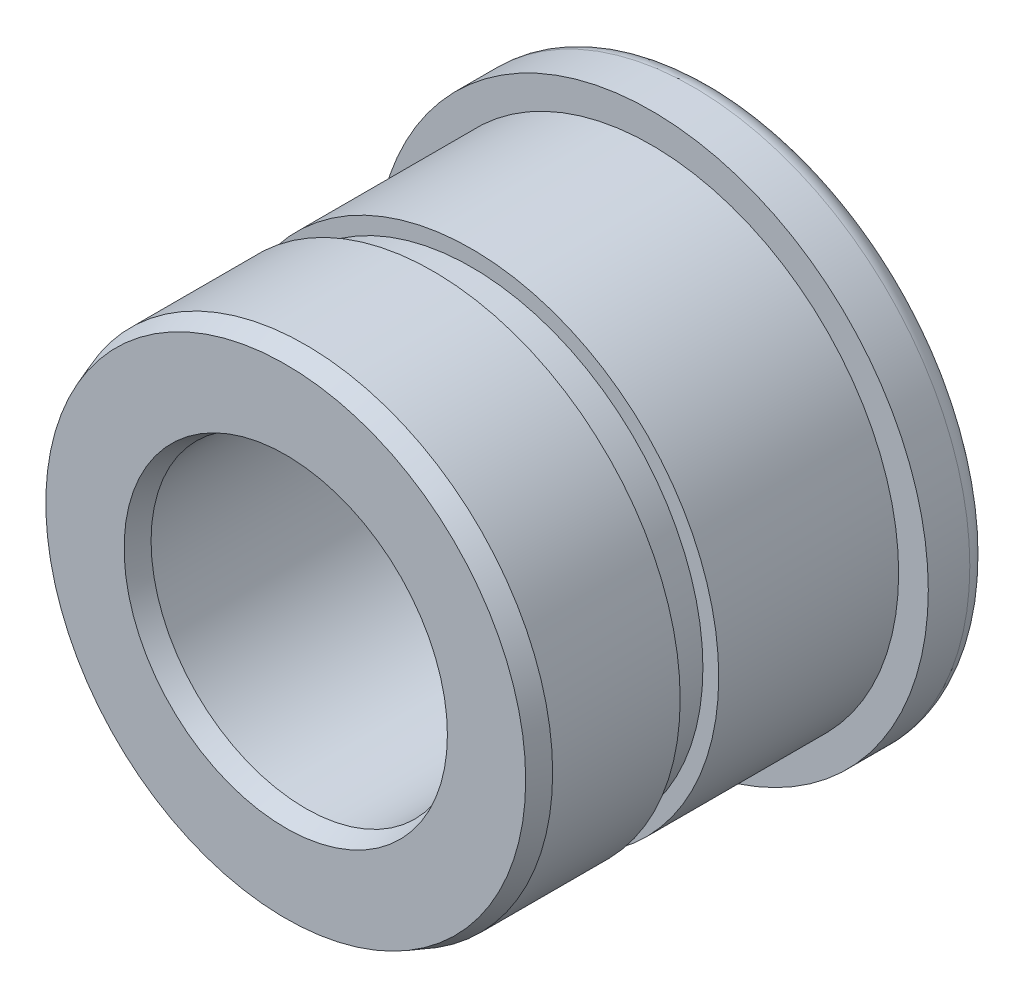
ISO-10303-21;
HEADER;
FILE_DESCRIPTION(('STEP AP214'),'2;1');
FILE_NAME('part.step','',(''),(''),'','','');
FILE_SCHEMA(('AUTOMOTIVE_DESIGN { 1 0 10303 214 1 1 1 1 }'));
ENDSEC;
DATA;
#1=APPLICATION_CONTEXT('core data for automotive mechanical design processes');
#2=APPLICATION_PROTOCOL_DEFINITION('international standard','automotive_design',2000,#1);
#3=PRODUCT_CONTEXT('',#1,'mechanical');
#4=PRODUCT('Part','Part','',(#3));
#5=PRODUCT_RELATED_PRODUCT_CATEGORY('part','',(#4));
#6=PRODUCT_DEFINITION_FORMATION('','',#4);
#7=PRODUCT_DEFINITION_CONTEXT('part definition',#1,'design');
#8=PRODUCT_DEFINITION('design','',#6,#7);
#9=PRODUCT_DEFINITION_SHAPE('','',#8);
#10=(LENGTH_UNIT() NAMED_UNIT(*) SI_UNIT(.MILLI.,.METRE.));
#11=(NAMED_UNIT(*) PLANE_ANGLE_UNIT() SI_UNIT($,.RADIAN.));
#12=(NAMED_UNIT(*) SI_UNIT($,.STERADIAN.) SOLID_ANGLE_UNIT());
#13=UNCERTAINTY_MEASURE_WITH_UNIT(LENGTH_MEASURE(1.E-05),#10,'distance_accuracy_value','');
#14=(GEOMETRIC_REPRESENTATION_CONTEXT(3) GLOBAL_UNCERTAINTY_ASSIGNED_CONTEXT((#13)) GLOBAL_UNIT_ASSIGNED_CONTEXT((#10,
#11,#12)) REPRESENTATION_CONTEXT('',''));
#15=CARTESIAN_POINT('',(0.,0.,0.));
#16=DIRECTION('',(0.,0.,1.));
#17=DIRECTION('',(1.,0.,0.));
#18=AXIS2_PLACEMENT_3D('',#15,#16,#17);
#19=CARTESIAN_POINT('',(0.,0.,1.5748));
#20=DIRECTION('',(0.,0.,-1.));
#21=DIRECTION('',(-1.,0.,0.));
#22=AXIS2_PLACEMENT_3D('',#19,#20,#21);
#23=CYLINDRICAL_SURFACE('',#22,7.112);
#24=CARTESIAN_POINT('',(0.,0.,0.508));
#25=DIRECTION('',(0.,0.,1.));
#26=DIRECTION('',(1.,0.,0.));
#27=AXIS2_PLACEMENT_3D('',#24,#25,#26);
#28=CIRCLE('',#27,7.112);
#29=CARTESIAN_POINT('',(7.112,0.,0.508));
#30=VERTEX_POINT('',#29);
#31=EDGE_CURVE('E60',#30,#30,#28,.T.);
#32=ORIENTED_EDGE('',*,*,#31,.T.);
#33=EDGE_LOOP('',(#32));
#34=FACE_BOUND('',#33,.T.);
#35=CARTESIAN_POINT('',(0.,0.,1.5748));
#36=DIRECTION('',(0.,0.,1.));
#37=DIRECTION('',(1.,0.,0.));
#38=AXIS2_PLACEMENT_3D('',#35,#36,#37);
#39=CIRCLE('',#38,7.112);
#40=CARTESIAN_POINT('',(7.112,0.,1.5748));
#41=VERTEX_POINT('',#40);
#42=EDGE_CURVE('E64',#41,#41,#39,.T.);
#43=ORIENTED_EDGE('',*,*,#42,.F.);
#44=EDGE_LOOP('',(#43));
#45=FACE_BOUND('',#44,.T.);
#46=ADVANCED_FACE('F31',(#34,#45),#23,.T.);
#47=CARTESIAN_POINT('',(0.,0.,1.5748));
#48=DIRECTION('',(0.,0.,1.));
#49=DIRECTION('',(1.,0.,0.));
#50=AXIS2_PLACEMENT_3D('',#47,#48,#49);
#51=PLANE('',#50);
#52=CARTESIAN_POINT('',(0.,0.,1.5748));
#53=DIRECTION('',(0.,0.,1.));
#54=DIRECTION('',(1.,0.,0.));
#55=AXIS2_PLACEMENT_3D('',#52,#53,#54);
#56=CIRCLE('',#55,6.35);
#57=CARTESIAN_POINT('',(6.35,0.,1.5748));
#58=VERTEX_POINT('',#57);
#59=EDGE_CURVE('E67',#58,#58,#56,.T.);
#60=ORIENTED_EDGE('',*,*,#59,.F.);
#61=EDGE_LOOP('',(#60));
#62=FACE_BOUND('',#61,.T.);
#63=ORIENTED_EDGE('',*,*,#42,.T.);
#64=EDGE_LOOP('',(#63));
#65=FACE_BOUND('',#64,.T.);
#66=ADVANCED_FACE('F100',(#62,#65),#51,.T.);
#67=CARTESIAN_POINT('',(0.,0.,0.));
#68=DIRECTION('',(0.,0.,1.));
#69=DIRECTION('',(1.,0.,0.));
#70=AXIS2_PLACEMENT_3D('',#67,#68,#69);
#71=PLANE('',#70);
#72=CARTESIAN_POINT('',(0.,0.,0.));
#73=DIRECTION('',(0.,0.,1.));
#74=DIRECTION('',(1.,0.,0.));
#75=AXIS2_PLACEMENT_3D('',#72,#73,#74);
#76=CIRCLE('',#75,4.15364687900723);
#77=CARTESIAN_POINT('',(4.15364687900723,0.,0.));
#78=VERTEX_POINT('',#77);
#79=EDGE_CURVE('E51',#78,#78,#76,.T.);
#80=ORIENTED_EDGE('',*,*,#79,.T.);
#81=EDGE_LOOP('',(#80));
#82=FACE_BOUND('',#81,.T.);
#83=CARTESIAN_POINT('',(0.,0.,0.));
#84=DIRECTION('',(0.,0.,1.));
#85=DIRECTION('',(1.,0.,0.));
#86=AXIS2_PLACEMENT_3D('',#83,#84,#85);
#87=CIRCLE('',#86,6.604);
#88=CARTESIAN_POINT('',(6.604,0.,0.));
#89=VERTEX_POINT('',#88);
#90=EDGE_CURVE('E57',#89,#89,#87,.F.);
#91=ORIENTED_EDGE('',*,*,#90,.T.);
#92=EDGE_LOOP('',(#91));
#93=FACE_BOUND('',#92,.T.);
#94=ADVANCED_FACE('F106',(#82,#93),#71,.F.);
#95=CARTESIAN_POINT('',(0.,0.,6.1976));
#96=DIRECTION('',(0.,0.,-1.));
#97=DIRECTION('',(-1.,0.,0.));
#98=AXIS2_PLACEMENT_3D('',#95,#96,#97);
#99=CYLINDRICAL_SURFACE('',#98,6.35);
#100=CARTESIAN_POINT('',(0.,0.,6.1976));
#101=DIRECTION('',(0.,0.,1.));
#102=DIRECTION('',(1.,0.,0.));
#103=AXIS2_PLACEMENT_3D('',#100,#101,#102);
#104=CIRCLE('',#103,6.35);
#105=CARTESIAN_POINT('',(6.35,0.,6.1976));
#106=VERTEX_POINT('',#105);
#107=EDGE_CURVE('E68',#106,#106,#104,.T.);
#108=ORIENTED_EDGE('',*,*,#107,.F.);
#109=EDGE_LOOP('',(#108));
#110=FACE_BOUND('',#109,.T.);
#111=ORIENTED_EDGE('',*,*,#59,.T.);
#112=EDGE_LOOP('',(#111));
#113=FACE_BOUND('',#112,.T.);
#114=ADVANCED_FACE('F178',(#110,#113),#99,.T.);
#115=CARTESIAN_POINT('',(0.,0.,6.1976));
#116=DIRECTION('',(0.,0.,1.));
#117=DIRECTION('',(1.,0.,0.));
#118=AXIS2_PLACEMENT_3D('',#115,#116,#117);
#119=PLANE('',#118);
#120=CARTESIAN_POINT('',(0.,0.,6.1976));
#121=DIRECTION('',(0.,0.,1.));
#122=DIRECTION('',(1.,0.,0.));
#123=AXIS2_PLACEMENT_3D('',#120,#121,#122);
#124=CIRCLE('',#123,5.9436);
#125=CARTESIAN_POINT('',(5.9436,0.,6.1976));
#126=VERTEX_POINT('',#125);
#127=EDGE_CURVE('E63',#126,#126,#124,.T.);
#128=ORIENTED_EDGE('',*,*,#127,.F.);
#129=EDGE_LOOP('',(#128));
#130=FACE_BOUND('',#129,.T.);
#131=ORIENTED_EDGE('',*,*,#107,.T.);
#132=EDGE_LOOP('',(#131));
#133=FACE_BOUND('',#132,.T.);
#134=ADVANCED_FACE('F200',(#130,#133),#119,.T.);
#135=CARTESIAN_POINT('',(0.,0.,7.1882));
#136=DIRECTION('',(0.,0.,-1.));
#137=DIRECTION('',(-1.,0.,0.));
#138=AXIS2_PLACEMENT_3D('',#135,#136,#137);
#139=CYLINDRICAL_SURFACE('',#138,5.9436);
#140=CARTESIAN_POINT('',(0.,0.,7.1882));
#141=DIRECTION('',(0.,0.,1.));
#142=DIRECTION('',(1.,0.,0.));
#143=AXIS2_PLACEMENT_3D('',#140,#141,#142);
#144=CIRCLE('',#143,5.9436);
#145=CARTESIAN_POINT('',(5.9436,0.,7.1882));
#146=VERTEX_POINT('',#145);
#147=EDGE_CURVE('E73',#146,#146,#144,.T.);
#148=ORIENTED_EDGE('',*,*,#147,.F.);
#149=EDGE_LOOP('',(#148));
#150=FACE_BOUND('',#149,.T.);
#151=ORIENTED_EDGE('',*,*,#127,.T.);
#152=EDGE_LOOP('',(#151));
#153=FACE_BOUND('',#152,.T.);
#154=ADVANCED_FACE('F151',(#150,#153),#139,.T.);
#155=CARTESIAN_POINT('',(0.,0.,10.9728));
#156=DIRECTION('',(0.,0.,-1.));
#157=DIRECTION('',(-1.,0.,0.));
#158=AXIS2_PLACEMENT_3D('',#155,#156,#157);
#159=CYLINDRICAL_SURFACE('',#158,6.35);
#160=CARTESIAN_POINT('',(0.,0.,10.4648));
#161=DIRECTION('',(0.,0.,1.));
#162=DIRECTION('',(1.,0.,0.));
#163=AXIS2_PLACEMENT_3D('',#160,#161,#162);
#164=CIRCLE('',#163,6.35);
#165=CARTESIAN_POINT('',(6.35,0.,10.4648));
#166=VERTEX_POINT('',#165);
#167=EDGE_CURVE('E10',#166,#166,#164,.F.);
#168=ORIENTED_EDGE('',*,*,#167,.T.);
#169=EDGE_LOOP('',(#168));
#170=FACE_BOUND('',#169,.T.);
#171=CARTESIAN_POINT('',(0.,0.,7.1882));
#172=DIRECTION('',(0.,0.,1.));
#173=DIRECTION('',(1.,0.,0.));
#174=AXIS2_PLACEMENT_3D('',#171,#172,#173);
#175=CIRCLE('',#174,6.35);
#176=CARTESIAN_POINT('',(6.35,0.,7.1882));
#177=VERTEX_POINT('',#176);
#178=EDGE_CURVE('E78',#177,#177,#175,.T.);
#179=ORIENTED_EDGE('',*,*,#178,.T.);
#180=EDGE_LOOP('',(#179));
#181=FACE_BOUND('',#180,.T.);
#182=ADVANCED_FACE('F82',(#170,#181),#159,.T.);
#183=CARTESIAN_POINT('',(0.,0.,10.9728));
#184=DIRECTION('',(0.,0.,1.));
#185=DIRECTION('',(1.,0.,0.));
#186=AXIS2_PLACEMENT_3D('',#183,#184,#185);
#187=PLANE('',#186);
#188=CARTESIAN_POINT('',(0.,0.,10.9728));
#189=DIRECTION('',(0.,0.,1.));
#190=DIRECTION('',(1.,0.,0.));
#191=AXIS2_PLACEMENT_3D('',#188,#189,#190);
#192=CIRCLE('',#191,6.16510312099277);
#193=CARTESIAN_POINT('',(6.16510312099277,0.,10.9728));
#194=VERTEX_POINT('',#193);
#195=EDGE_CURVE('E38',#194,#194,#192,.T.);
#196=ORIENTED_EDGE('',*,*,#195,.T.);
#197=EDGE_LOOP('',(#196));
#198=FACE_BOUND('',#197,.T.);
#199=CARTESIAN_POINT('',(0.,0.,10.9728));
#200=DIRECTION('',(0.,0.,1.));
#201=DIRECTION('',(1.,0.,0.));
#202=AXIS2_PLACEMENT_3D('',#199,#200,#201);
#203=CIRCLE('',#202,4.15364687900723);
#204=CARTESIAN_POINT('',(4.15364687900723,0.,10.9728));
#205=VERTEX_POINT('',#204);
#206=EDGE_CURVE('E46',#205,#205,#203,.F.);
#207=ORIENTED_EDGE('',*,*,#206,.T.);
#208=EDGE_LOOP('',(#207));
#209=FACE_BOUND('',#208,.T.);
#210=ADVANCED_FACE('F87',(#198,#209),#187,.T.);
#211=CARTESIAN_POINT('',(0.,0.,7.1882));
#212=DIRECTION('',(0.,0.,1.));
#213=DIRECTION('',(1.,0.,0.));
#214=AXIS2_PLACEMENT_3D('',#211,#212,#213);
#215=PLANE('',#214);
#216=ORIENTED_EDGE('',*,*,#147,.T.);
#217=EDGE_LOOP('',(#216));
#218=FACE_BOUND('',#217,.T.);
#219=ORIENTED_EDGE('',*,*,#178,.F.);
#220=EDGE_LOOP('',(#219));
#221=FACE_BOUND('',#220,.T.);
#222=ADVANCED_FACE('F84',(#218,#221),#215,.F.);
#223=CARTESIAN_POINT('',(0.,0.,0.));
#224=DIRECTION('',(0.,0.,-1.));
#225=DIRECTION('',(-1.,0.,0.));
#226=AXIS2_PLACEMENT_3D('',#223,#224,#225);
#227=CYLINDRICAL_SURFACE('',#226,3.96875);
#228=CARTESIAN_POINT('',(0.,0.,10.4648));
#229=DIRECTION('',(0.,0.,1.));
#230=DIRECTION('',(1.,0.,0.));
#231=AXIS2_PLACEMENT_3D('',#228,#229,#230);
#232=CIRCLE('',#231,3.96875);
#233=CARTESIAN_POINT('',(3.96875,0.,10.4648));
#234=VERTEX_POINT('',#233);
#235=EDGE_CURVE('E42',#234,#234,#232,.T.);
#236=ORIENTED_EDGE('',*,*,#235,.T.);
#237=EDGE_LOOP('',(#236));
#238=FACE_BOUND('',#237,.T.);
#239=CARTESIAN_POINT('',(0.,0.,0.508000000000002));
#240=DIRECTION('',(0.,0.,1.));
#241=DIRECTION('',(1.,0.,0.));
#242=AXIS2_PLACEMENT_3D('',#239,#240,#241);
#243=CIRCLE('',#242,3.96875);
#244=CARTESIAN_POINT('',(3.96875,0.,0.508000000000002));
#245=VERTEX_POINT('',#244);
#246=EDGE_CURVE('E54',#245,#245,#243,.F.);
#247=ORIENTED_EDGE('',*,*,#246,.T.);
#248=EDGE_LOOP('',(#247));
#249=FACE_BOUND('',#248,.T.);
#250=ADVANCED_FACE('F86',(#238,#249),#227,.F.);
#251=CARTESIAN_POINT('',(0.,0.,0.508));
#252=DIRECTION('',(0.,0.,1.));
#253=DIRECTION('',(1.,0.,0.));
#254=AXIS2_PLACEMENT_3D('',#251,#252,#253);
#255=TOROIDAL_SURFACE('',#254,6.604,0.508);
#256=ORIENTED_EDGE('',*,*,#90,.F.);
#257=EDGE_LOOP('',(#256));
#258=FACE_BOUND('',#257,.T.);
#259=ORIENTED_EDGE('',*,*,#31,.F.);
#260=EDGE_LOOP('',(#259));
#261=FACE_BOUND('',#260,.T.);
#262=ADVANCED_FACE('F94',(#258,#261),#255,.T.);
#263=CARTESIAN_POINT('',(0.,0.,0.508000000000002));
#264=DIRECTION('',(0.,0.,-1.));
#265=DIRECTION('',(-1.,0.,0.));
#266=AXIS2_PLACEMENT_3D('',#263,#264,#265);
#267=CONICAL_SURFACE('',#266,3.96875,0.349065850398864);
#268=ORIENTED_EDGE('',*,*,#79,.F.);
#269=EDGE_LOOP('',(#268));
#270=FACE_BOUND('',#269,.T.);
#271=ORIENTED_EDGE('',*,*,#246,.F.);
#272=EDGE_LOOP('',(#271));
#273=FACE_BOUND('',#272,.T.);
#274=ADVANCED_FACE('F114',(#270,#273),#267,.F.);
#275=CARTESIAN_POINT('',(0.,0.,10.9728));
#276=DIRECTION('',(0.,0.,1.));
#277=DIRECTION('',(1.,0.,0.));
#278=AXIS2_PLACEMENT_3D('',#275,#276,#277);
#279=CONICAL_SURFACE('',#278,4.15364687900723,0.349065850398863);
#280=ORIENTED_EDGE('',*,*,#235,.F.);
#281=EDGE_LOOP('',(#280));
#282=FACE_BOUND('',#281,.T.);
#283=ORIENTED_EDGE('',*,*,#206,.F.);
#284=EDGE_LOOP('',(#283));
#285=FACE_BOUND('',#284,.T.);
#286=ADVANCED_FACE('F117',(#282,#285),#279,.F.);
#287=CARTESIAN_POINT('',(0.,0.,10.9728));
#288=DIRECTION('',(0.,0.,-1.));
#289=DIRECTION('',(-1.,0.,0.));
#290=AXIS2_PLACEMENT_3D('',#287,#288,#289);
#291=CONICAL_SURFACE('',#290,6.16510312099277,0.349065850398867);
#292=ORIENTED_EDGE('',*,*,#167,.F.);
#293=EDGE_LOOP('',(#292));
#294=FACE_BOUND('',#293,.T.);
#295=ORIENTED_EDGE('',*,*,#195,.F.);
#296=EDGE_LOOP('',(#295));
#297=FACE_BOUND('',#296,.T.);
#298=ADVANCED_FACE('F33',(#294,#297),#291,.T.);
#299=CLOSED_SHELL('',(#46,#66,#94,#114,#134,#154,#182,#210,#222,#250,#262,#274,#286,#298));
#300=MANIFOLD_SOLID_BREP('B2',#299);
#301=ADVANCED_BREP_SHAPE_REPRESENTATION('',(#18,#300),#14);
#302=SHAPE_DEFINITION_REPRESENTATION(#9,#301);
ENDSEC;
END-ISO-10303-21;
